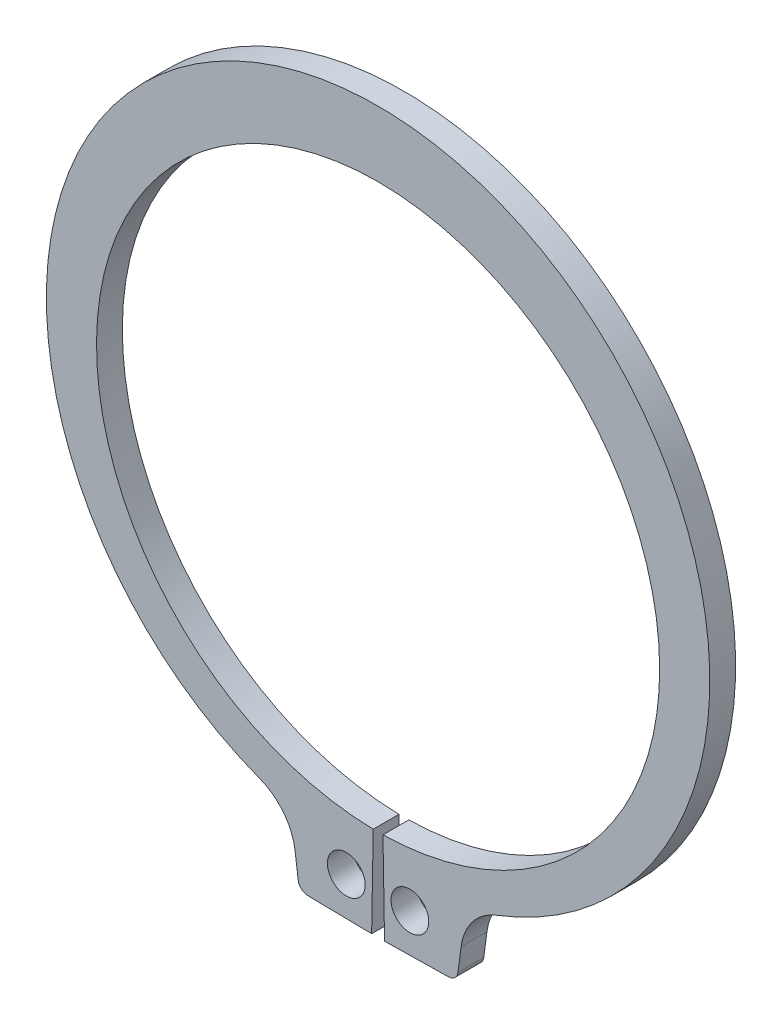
ISO-10303-21;
HEADER;
FILE_DESCRIPTION(('STEP AP214'),'2;1');
FILE_NAME('part.step','',(''),(''),'','','');
FILE_SCHEMA(('AUTOMOTIVE_DESIGN { 1 0 10303 214 1 1 1 1 }'));
ENDSEC;
DATA;
#1=APPLICATION_CONTEXT('core data for automotive mechanical design processes');
#2=APPLICATION_PROTOCOL_DEFINITION('international standard','automotive_design',2000,#1);
#3=PRODUCT_CONTEXT('',#1,'mechanical');
#4=PRODUCT('Part','Part','',(#3));
#5=PRODUCT_RELATED_PRODUCT_CATEGORY('part','',(#4));
#6=PRODUCT_DEFINITION_FORMATION('','',#4);
#7=PRODUCT_DEFINITION_CONTEXT('part definition',#1,'design');
#8=PRODUCT_DEFINITION('design','',#6,#7);
#9=PRODUCT_DEFINITION_SHAPE('','',#8);
#10=(LENGTH_UNIT() NAMED_UNIT(*) SI_UNIT(.MILLI.,.METRE.));
#11=(NAMED_UNIT(*) PLANE_ANGLE_UNIT() SI_UNIT($,.RADIAN.));
#12=(NAMED_UNIT(*) SI_UNIT($,.STERADIAN.) SOLID_ANGLE_UNIT());
#13=UNCERTAINTY_MEASURE_WITH_UNIT(LENGTH_MEASURE(1.E-05),#10,'distance_accuracy_value','');
#14=(GEOMETRIC_REPRESENTATION_CONTEXT(3) GLOBAL_UNCERTAINTY_ASSIGNED_CONTEXT((#13)) GLOBAL_UNIT_ASSIGNED_CONTEXT((#10,
#11,#12)) REPRESENTATION_CONTEXT('',''));
#15=CARTESIAN_POINT('',(0.,0.,0.));
#16=DIRECTION('',(0.,0.,1.));
#17=DIRECTION('',(1.,0.,0.));
#18=AXIS2_PLACEMENT_3D('',#15,#16,#17);
#19=CARTESIAN_POINT('',(0.,0.,-1.3));
#20=DIRECTION('',(0.,0.,1.));
#21=DIRECTION('',(1.,0.,0.));
#22=AXIS2_PLACEMENT_3D('',#19,#20,#21);
#23=CYLINDRICAL_SURFACE('',#22,14.175);
#24=CARTESIAN_POINT('',(0.,0.,0.));
#25=DIRECTION('',(0.,0.,-1.));
#26=DIRECTION('',(1.,0.,0.));
#27=AXIS2_PLACEMENT_3D('',#24,#25,#26);
#28=CIRCLE('',#27,14.175);
#29=CARTESIAN_POINT('',(-0.245372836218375,-14.1728761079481,0.));
#30=VERTEX_POINT('',#29);
#31=CARTESIAN_POINT('',(0.245372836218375,-14.1728761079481,0.));
#32=VERTEX_POINT('',#31);
#33=EDGE_CURVE('E116',#30,#32,#28,.T.);
#34=ORIENTED_EDGE('',*,*,#33,.F.);
#35=DIRECTION('',(0.,0.,1.));
#36=VECTOR('',#35,1.);
#37=CARTESIAN_POINT('',(-0.245372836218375,-14.1728761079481,-1.3));
#38=LINE('',#37,#36);
#39=CARTESIAN_POINT('',(-0.245372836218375,-14.1728761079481,-1.3));
#40=VERTEX_POINT('',#39);
#41=EDGE_CURVE('E11',#40,#30,#38,.T.);
#42=ORIENTED_EDGE('',*,*,#41,.F.);
#43=CARTESIAN_POINT('',(0.,0.,-1.3));
#44=DIRECTION('',(0.,0.,-1.));
#45=DIRECTION('',(1.,0.,0.));
#46=AXIS2_PLACEMENT_3D('',#43,#44,#45);
#47=CIRCLE('',#46,14.175);
#48=CARTESIAN_POINT('',(0.245372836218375,-14.1728761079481,-1.3));
#49=VERTEX_POINT('',#48);
#50=EDGE_CURVE('E118',#40,#49,#47,.T.);
#51=ORIENTED_EDGE('',*,*,#50,.T.);
#52=DIRECTION('',(0.,0.,1.));
#53=VECTOR('',#52,1.);
#54=CARTESIAN_POINT('',(0.245372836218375,-14.1728761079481,-1.3));
#55=LINE('',#54,#53);
#56=EDGE_CURVE('E31',#49,#32,#55,.T.);
#57=ORIENTED_EDGE('',*,*,#56,.T.);
#58=EDGE_LOOP('',(#34,#42,#51,#57));
#59=FACE_BOUND('',#58,.T.);
#60=ADVANCED_FACE('F28',(#59),#23,.F.);
#61=CARTESIAN_POINT('',(-0.245372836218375,-14.1728761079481,-1.3));
#62=DIRECTION('',(0.999850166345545,-0.0173102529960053,0.));
#63=DIRECTION('',(0.0173102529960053,0.999850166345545,0.));
#64=AXIS2_PLACEMENT_3D('',#61,#62,#63);
#65=PLANE('',#64);
#66=DIRECTION('',(0.0173102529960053,0.999850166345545,0.));
#67=VECTOR('',#66,1.);
#68=CARTESIAN_POINT('',(-0.245372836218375,-14.1728761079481,0.));
#69=LINE('',#68,#67);
#70=CARTESIAN_POINT('',(-0.325,-18.7721868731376,0.));
#71=VERTEX_POINT('',#70);
#72=EDGE_CURVE('E134',#71,#30,#69,.T.);
#73=ORIENTED_EDGE('',*,*,#72,.F.);
#74=DIRECTION('',(0.,0.,1.));
#75=VECTOR('',#74,1.);
#76=CARTESIAN_POINT('',(-0.325,-18.7721868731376,-1.3));
#77=LINE('',#76,#75);
#78=CARTESIAN_POINT('',(-0.325,-18.7721868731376,-1.3));
#79=VERTEX_POINT('',#78);
#80=EDGE_CURVE('E36',#79,#71,#77,.T.);
#81=ORIENTED_EDGE('',*,*,#80,.F.);
#82=DIRECTION('',(0.0173102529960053,0.999850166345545,0.));
#83=VECTOR('',#82,1.);
#84=CARTESIAN_POINT('',(-0.245372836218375,-14.1728761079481,-1.3));
#85=LINE('',#84,#83);
#86=EDGE_CURVE('E123',#79,#40,#85,.T.);
#87=ORIENTED_EDGE('',*,*,#86,.T.);
#88=ORIENTED_EDGE('',*,*,#41,.T.);
#89=EDGE_LOOP('',(#73,#81,#87,#88));
#90=FACE_BOUND('',#89,.T.);
#91=ADVANCED_FACE('F246',(#90),#65,.T.);
#92=CARTESIAN_POINT('',(-0.325,-18.7721868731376,-1.3));
#93=DIRECTION('',(-0.0173102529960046,-0.999850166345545,0.));
#94=DIRECTION('',(0.999850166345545,-0.0173102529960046,0.));
#95=AXIS2_PLACEMENT_3D('',#92,#93,#94);
#96=PLANE('',#95);
#97=DIRECTION('',(0.999850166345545,-0.0173102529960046,0.));
#98=VECTOR('',#97,1.);
#99=CARTESIAN_POINT('',(-0.325,-18.7721868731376,0.));
#100=LINE('',#99,#98);
#101=CARTESIAN_POINT('',(-3.53427573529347,-18.7166251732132,0.));
#102=VERTEX_POINT('',#101);
#103=EDGE_CURVE('E164',#102,#71,#100,.T.);
#104=ORIENTED_EDGE('',*,*,#103,.F.);
#105=DIRECTION('',(0.,0.,1.));
#106=VECTOR('',#105,1.);
#107=CARTESIAN_POINT('',(-3.53427573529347,-18.7166251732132,-1.3));
#108=LINE('',#107,#106);
#109=CARTESIAN_POINT('',(-3.53427573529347,-18.7166251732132,-1.3));
#110=VERTEX_POINT('',#109);
#111=EDGE_CURVE('E198',#110,#102,#108,.T.);
#112=ORIENTED_EDGE('',*,*,#111,.F.);
#113=DIRECTION('',(0.999850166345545,-0.0173102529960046,0.));
#114=VECTOR('',#113,1.);
#115=CARTESIAN_POINT('',(-0.325,-18.7721868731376,-1.3));
#116=LINE('',#115,#114);
#117=EDGE_CURVE('E194',#110,#79,#116,.T.);
#118=ORIENTED_EDGE('',*,*,#117,.T.);
#119=ORIENTED_EDGE('',*,*,#80,.T.);
#120=EDGE_LOOP('',(#104,#112,#118,#119));
#121=FACE_BOUND('',#120,.T.);
#122=ADVANCED_FACE('F251',(#121),#96,.T.);
#123=CARTESIAN_POINT('',(-3.52562060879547,-18.2167000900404,-1.3));
#124=DIRECTION('',(0.,0.,1.));
#125=DIRECTION('',(1.,0.,0.));
#126=AXIS2_PLACEMENT_3D('',#123,#124,#125);
#127=CYLINDRICAL_SURFACE('',#126,0.5);
#128=CARTESIAN_POINT('',(-3.52562060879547,-18.2167000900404,0.));
#129=DIRECTION('',(0.,0.,1.));
#130=DIRECTION('',(1.,0.,0.));
#131=AXIS2_PLACEMENT_3D('',#128,#129,#130);
#132=CIRCLE('',#131,0.5);
#133=CARTESIAN_POINT('',(-4.02134303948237,-18.2819631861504,0.));
#134=VERTEX_POINT('',#133);
#135=EDGE_CURVE('E161',#134,#102,#132,.T.);
#136=ORIENTED_EDGE('',*,*,#135,.F.);
#137=DIRECTION('',(0.,0.,1.));
#138=VECTOR('',#137,1.);
#139=CARTESIAN_POINT('',(-4.02134303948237,-18.2819631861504,-1.3));
#140=LINE('',#139,#138);
#141=CARTESIAN_POINT('',(-4.02134303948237,-18.2819631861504,-1.3));
#142=VERTEX_POINT('',#141);
#143=EDGE_CURVE('E200',#142,#134,#140,.T.);
#144=ORIENTED_EDGE('',*,*,#143,.F.);
#145=CARTESIAN_POINT('',(-3.52562060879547,-18.2167000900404,-1.3));
#146=DIRECTION('',(0.,0.,1.));
#147=DIRECTION('',(1.,0.,0.));
#148=AXIS2_PLACEMENT_3D('',#145,#146,#147);
#149=CIRCLE('',#148,0.5);
#150=EDGE_CURVE('E191',#142,#110,#149,.T.);
#151=ORIENTED_EDGE('',*,*,#150,.T.);
#152=ORIENTED_EDGE('',*,*,#111,.T.);
#153=EDGE_LOOP('',(#136,#144,#151,#152));
#154=FACE_BOUND('',#153,.T.);
#155=ADVANCED_FACE('F243',(#154),#127,.T.);
#156=CARTESIAN_POINT('',(-4.18045351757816,-17.0733991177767,-1.3));
#157=DIRECTION('',(-0.99144486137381,-0.130526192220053,0.));
#158=DIRECTION('',(0.130526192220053,-0.99144486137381,0.));
#159=AXIS2_PLACEMENT_3D('',#156,#157,#158);
#160=PLANE('',#159);
#161=DIRECTION('',(0.130526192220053,-0.99144486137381,0.));
#162=VECTOR('',#161,1.);
#163=CARTESIAN_POINT('',(-4.18045351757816,-17.0733991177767,0.));
#164=LINE('',#163,#162);
#165=CARTESIAN_POINT('',(-4.18045351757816,-17.0733991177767,0.));
#166=VERTEX_POINT('',#165);
#167=EDGE_CURVE('E158',#166,#134,#164,.T.);
#168=ORIENTED_EDGE('',*,*,#167,.F.);
#169=DIRECTION('',(0.,0.,1.));
#170=VECTOR('',#169,1.);
#171=CARTESIAN_POINT('',(-4.18045351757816,-17.0733991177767,-1.3));
#172=LINE('',#171,#170);
#173=CARTESIAN_POINT('',(-4.18045351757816,-17.0733991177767,-1.3));
#174=VERTEX_POINT('',#173);
#175=EDGE_CURVE('E202',#174,#166,#172,.T.);
#176=ORIENTED_EDGE('',*,*,#175,.F.);
#177=DIRECTION('',(0.130526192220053,-0.99144486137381,0.));
#178=VECTOR('',#177,1.);
#179=CARTESIAN_POINT('',(-4.18045351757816,-17.0733991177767,-1.3));
#180=LINE('',#179,#178);
#181=EDGE_CURVE('E188',#174,#142,#180,.T.);
#182=ORIENTED_EDGE('',*,*,#181,.T.);
#183=ORIENTED_EDGE('',*,*,#143,.T.);
#184=EDGE_LOOP('',(#168,#176,#182,#183));
#185=FACE_BOUND('',#184,.T.);
#186=ADVANCED_FACE('F239',(#185),#160,.T.);
#187=CARTESIAN_POINT('',(-6.95614636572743,-17.438826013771,-1.3));
#188=DIRECTION('',(0.,0.,1.));
#189=DIRECTION('',(1.,0.,0.));
#190=AXIS2_PLACEMENT_3D('',#187,#188,#189);
#191=CYLINDRICAL_SURFACE('',#190,2.79964419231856);
#192=CARTESIAN_POINT('',(-6.95614636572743,-17.438826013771,0.));
#193=DIRECTION('',(0.,0.,-1.));
#194=DIRECTION('',(1.,0.,0.));
#195=AXIS2_PLACEMENT_3D('',#192,#193,#194);
#196=CIRCLE('',#195,2.79964419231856);
#197=CARTESIAN_POINT('',(-5.95735269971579,-14.8234065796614,0.));
#198=VERTEX_POINT('',#197);
#199=EDGE_CURVE('E155',#198,#166,#196,.T.);
#200=ORIENTED_EDGE('',*,*,#199,.F.);
#201=DIRECTION('',(0.,0.,1.));
#202=VECTOR('',#201,1.);
#203=CARTESIAN_POINT('',(-5.95735269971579,-14.8234065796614,-1.3));
#204=LINE('',#203,#202);
#205=CARTESIAN_POINT('',(-5.95735269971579,-14.8234065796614,-1.3));
#206=VERTEX_POINT('',#205);
#207=EDGE_CURVE('E204',#206,#198,#204,.T.);
#208=ORIENTED_EDGE('',*,*,#207,.F.);
#209=CARTESIAN_POINT('',(-6.95614636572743,-17.438826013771,-1.3));
#210=DIRECTION('',(0.,0.,-1.));
#211=DIRECTION('',(1.,0.,0.));
#212=AXIS2_PLACEMENT_3D('',#209,#210,#211);
#213=CIRCLE('',#212,2.79964419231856);
#214=EDGE_CURVE('E185',#206,#174,#213,.T.);
#215=ORIENTED_EDGE('',*,*,#214,.T.);
#216=ORIENTED_EDGE('',*,*,#175,.T.);
#217=EDGE_LOOP('',(#200,#208,#215,#216));
#218=FACE_BOUND('',#217,.T.);
#219=ADVANCED_FACE('F235',(#218),#191,.F.);
#220=CARTESIAN_POINT('',(0.,0.776388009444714,-1.3));
#221=DIRECTION('',(0.,0.,1.));
#222=DIRECTION('',(1.,0.,0.));
#223=AXIS2_PLACEMENT_3D('',#220,#221,#222);
#224=CYLINDRICAL_SURFACE('',#223,16.6986119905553);
#225=CARTESIAN_POINT('',(0.,0.776388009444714,0.));
#226=DIRECTION('',(0.,0.,1.));
#227=DIRECTION('',(1.,0.,0.));
#228=AXIS2_PLACEMENT_3D('',#225,#226,#227);
#229=CIRCLE('',#228,16.6986119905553);
#230=CARTESIAN_POINT('',(5.95735269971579,-14.8234065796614,0.));
#231=VERTEX_POINT('',#230);
#232=EDGE_CURVE('E152',#231,#198,#229,.T.);
#233=ORIENTED_EDGE('',*,*,#232,.F.);
#234=DIRECTION('',(0.,0.,1.));
#235=VECTOR('',#234,1.);
#236=CARTESIAN_POINT('',(5.95735269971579,-14.8234065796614,-1.3));
#237=LINE('',#236,#235);
#238=CARTESIAN_POINT('',(5.95735269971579,-14.8234065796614,-1.3));
#239=VERTEX_POINT('',#238);
#240=EDGE_CURVE('E206',#239,#231,#237,.T.);
#241=ORIENTED_EDGE('',*,*,#240,.F.);
#242=CARTESIAN_POINT('',(0.,0.776388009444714,-1.3));
#243=DIRECTION('',(0.,0.,1.));
#244=DIRECTION('',(1.,0.,0.));
#245=AXIS2_PLACEMENT_3D('',#242,#243,#244);
#246=CIRCLE('',#245,16.6986119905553);
#247=EDGE_CURVE('E182',#239,#206,#246,.T.);
#248=ORIENTED_EDGE('',*,*,#247,.T.);
#249=ORIENTED_EDGE('',*,*,#207,.T.);
#250=EDGE_LOOP('',(#233,#241,#248,#249));
#251=FACE_BOUND('',#250,.T.);
#252=ADVANCED_FACE('F231',(#251),#224,.T.);
#253=CARTESIAN_POINT('',(6.95614636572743,-17.438826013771,-1.3));
#254=DIRECTION('',(0.,0.,1.));
#255=DIRECTION('',(1.,0.,0.));
#256=AXIS2_PLACEMENT_3D('',#253,#254,#255);
#257=CYLINDRICAL_SURFACE('',#256,2.79964419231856);
#258=CARTESIAN_POINT('',(6.95614636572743,-17.438826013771,0.));
#259=DIRECTION('',(0.,0.,-1.));
#260=DIRECTION('',(1.,0.,0.));
#261=AXIS2_PLACEMENT_3D('',#258,#259,#260);
#262=CIRCLE('',#261,2.79964419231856);
#263=CARTESIAN_POINT('',(4.18045351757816,-17.0733991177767,0.));
#264=VERTEX_POINT('',#263);
#265=EDGE_CURVE('E149',#264,#231,#262,.T.);
#266=ORIENTED_EDGE('',*,*,#265,.F.);
#267=DIRECTION('',(0.,0.,1.));
#268=VECTOR('',#267,1.);
#269=CARTESIAN_POINT('',(4.18045351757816,-17.0733991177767,-1.3));
#270=LINE('',#269,#268);
#271=CARTESIAN_POINT('',(4.18045351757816,-17.0733991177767,-1.3));
#272=VERTEX_POINT('',#271);
#273=EDGE_CURVE('E208',#272,#264,#270,.T.);
#274=ORIENTED_EDGE('',*,*,#273,.F.);
#275=CARTESIAN_POINT('',(6.95614636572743,-17.438826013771,-1.3));
#276=DIRECTION('',(0.,0.,-1.));
#277=DIRECTION('',(1.,0.,0.));
#278=AXIS2_PLACEMENT_3D('',#275,#276,#277);
#279=CIRCLE('',#278,2.79964419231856);
#280=EDGE_CURVE('E179',#272,#239,#279,.T.);
#281=ORIENTED_EDGE('',*,*,#280,.T.);
#282=ORIENTED_EDGE('',*,*,#240,.T.);
#283=EDGE_LOOP('',(#266,#274,#281,#282));
#284=FACE_BOUND('',#283,.T.);
#285=ADVANCED_FACE('F227',(#284),#257,.F.);
#286=CARTESIAN_POINT('',(4.18045351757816,-17.0733991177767,-1.3));
#287=DIRECTION('',(0.99144486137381,-0.130526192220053,0.));
#288=DIRECTION('',(0.130526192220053,0.99144486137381,0.));
#289=AXIS2_PLACEMENT_3D('',#286,#287,#288);
#290=PLANE('',#289);
#291=DIRECTION('',(0.130526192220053,0.99144486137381,0.));
#292=VECTOR('',#291,1.);
#293=CARTESIAN_POINT('',(4.18045351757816,-17.0733991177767,0.));
#294=LINE('',#293,#292);
#295=CARTESIAN_POINT('',(4.02134303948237,-18.2819631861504,0.));
#296=VERTEX_POINT('',#295);
#297=EDGE_CURVE('E146',#296,#264,#294,.T.);
#298=ORIENTED_EDGE('',*,*,#297,.F.);
#299=DIRECTION('',(0.,0.,1.));
#300=VECTOR('',#299,1.);
#301=CARTESIAN_POINT('',(4.02134303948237,-18.2819631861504,-1.3));
#302=LINE('',#301,#300);
#303=CARTESIAN_POINT('',(4.02134303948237,-18.2819631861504,-1.3));
#304=VERTEX_POINT('',#303);
#305=EDGE_CURVE('E210',#304,#296,#302,.T.);
#306=ORIENTED_EDGE('',*,*,#305,.F.);
#307=DIRECTION('',(0.130526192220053,0.99144486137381,0.));
#308=VECTOR('',#307,1.);
#309=CARTESIAN_POINT('',(4.18045351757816,-17.0733991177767,-1.3));
#310=LINE('',#309,#308);
#311=EDGE_CURVE('E176',#304,#272,#310,.T.);
#312=ORIENTED_EDGE('',*,*,#311,.T.);
#313=ORIENTED_EDGE('',*,*,#273,.T.);
#314=EDGE_LOOP('',(#298,#306,#312,#313));
#315=FACE_BOUND('',#314,.T.);
#316=ADVANCED_FACE('F223',(#315),#290,.T.);
#317=CARTESIAN_POINT('',(3.52562060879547,-18.2167000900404,-1.3));
#318=DIRECTION('',(0.,0.,1.));
#319=DIRECTION('',(1.,0.,0.));
#320=AXIS2_PLACEMENT_3D('',#317,#318,#319);
#321=CYLINDRICAL_SURFACE('',#320,0.5);
#322=CARTESIAN_POINT('',(3.52562060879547,-18.2167000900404,0.));
#323=DIRECTION('',(0.,0.,1.));
#324=DIRECTION('',(-1.,0.,0.));
#325=AXIS2_PLACEMENT_3D('',#322,#323,#324);
#326=CIRCLE('',#325,0.5);
#327=CARTESIAN_POINT('',(3.53427573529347,-18.7166251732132,0.));
#328=VERTEX_POINT('',#327);
#329=EDGE_CURVE('E143',#328,#296,#326,.T.);
#330=ORIENTED_EDGE('',*,*,#329,.F.);
#331=DIRECTION('',(0.,0.,1.));
#332=VECTOR('',#331,1.);
#333=CARTESIAN_POINT('',(3.53427573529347,-18.7166251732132,-1.3));
#334=LINE('',#333,#332);
#335=CARTESIAN_POINT('',(3.53427573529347,-18.7166251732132,-1.3));
#336=VERTEX_POINT('',#335);
#337=EDGE_CURVE('E212',#336,#328,#334,.T.);
#338=ORIENTED_EDGE('',*,*,#337,.F.);
#339=CARTESIAN_POINT('',(3.52562060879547,-18.2167000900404,-1.3));
#340=DIRECTION('',(0.,0.,1.));
#341=DIRECTION('',(-1.,0.,0.));
#342=AXIS2_PLACEMENT_3D('',#339,#340,#341);
#343=CIRCLE('',#342,0.5);
#344=EDGE_CURVE('E173',#336,#304,#343,.T.);
#345=ORIENTED_EDGE('',*,*,#344,.T.);
#346=ORIENTED_EDGE('',*,*,#305,.T.);
#347=EDGE_LOOP('',(#330,#338,#345,#346));
#348=FACE_BOUND('',#347,.T.);
#349=ADVANCED_FACE('F219',(#348),#321,.T.);
#350=CARTESIAN_POINT('',(0.325,-18.7721868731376,-1.3));
#351=DIRECTION('',(0.0173102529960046,-0.999850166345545,0.));
#352=DIRECTION('',(0.999850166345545,0.0173102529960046,0.));
#353=AXIS2_PLACEMENT_3D('',#350,#351,#352);
#354=PLANE('',#353);
#355=DIRECTION('',(0.999850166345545,0.0173102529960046,0.));
#356=VECTOR('',#355,1.);
#357=CARTESIAN_POINT('',(0.325,-18.7721868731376,0.));
#358=LINE('',#357,#356);
#359=CARTESIAN_POINT('',(0.325,-18.7721868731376,0.));
#360=VERTEX_POINT('',#359);
#361=EDGE_CURVE('E130',#360,#328,#358,.T.);
#362=ORIENTED_EDGE('',*,*,#361,.F.);
#363=DIRECTION('',(0.,0.,1.));
#364=VECTOR('',#363,1.);
#365=CARTESIAN_POINT('',(0.325,-18.7721868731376,-1.3));
#366=LINE('',#365,#364);
#367=CARTESIAN_POINT('',(0.325,-18.7721868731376,-1.3));
#368=VERTEX_POINT('',#367);
#369=EDGE_CURVE('E122',#368,#360,#366,.T.);
#370=ORIENTED_EDGE('',*,*,#369,.F.);
#371=DIRECTION('',(0.999850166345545,0.0173102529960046,0.));
#372=VECTOR('',#371,1.);
#373=CARTESIAN_POINT('',(0.325,-18.7721868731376,-1.3));
#374=LINE('',#373,#372);
#375=EDGE_CURVE('E170',#368,#336,#374,.T.);
#376=ORIENTED_EDGE('',*,*,#375,.T.);
#377=ORIENTED_EDGE('',*,*,#337,.T.);
#378=EDGE_LOOP('',(#362,#370,#376,#377));
#379=FACE_BOUND('',#378,.T.);
#380=ADVANCED_FACE('F215',(#379),#354,.T.);
#381=CARTESIAN_POINT('',(0.245372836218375,-14.1728761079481,-1.3));
#382=DIRECTION('',(-0.999850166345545,-0.0173102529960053,0.));
#383=DIRECTION('',(0.0173102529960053,-0.999850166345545,0.));
#384=AXIS2_PLACEMENT_3D('',#381,#382,#383);
#385=PLANE('',#384);
#386=DIRECTION('',(0.0173102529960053,-0.999850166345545,0.));
#387=VECTOR('',#386,1.);
#388=CARTESIAN_POINT('',(0.245372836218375,-14.1728761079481,0.));
#389=LINE('',#388,#387);
#390=EDGE_CURVE('E125',#32,#360,#389,.T.);
#391=ORIENTED_EDGE('',*,*,#390,.F.);
#392=ORIENTED_EDGE('',*,*,#56,.F.);
#393=DIRECTION('',(0.0173102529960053,-0.999850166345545,0.));
#394=VECTOR('',#393,1.);
#395=CARTESIAN_POINT('',(0.245372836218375,-14.1728761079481,-1.3));
#396=LINE('',#395,#394);
#397=EDGE_CURVE('E168',#49,#368,#396,.T.);
#398=ORIENTED_EDGE('',*,*,#397,.T.);
#399=ORIENTED_EDGE('',*,*,#369,.T.);
#400=EDGE_LOOP('',(#391,#392,#398,#399));
#401=FACE_BOUND('',#400,.T.);
#402=ADVANCED_FACE('F126',(#401),#385,.T.);
#403=CARTESIAN_POINT('',(0.,0.,-1.3));
#404=DIRECTION('',(0.,0.,1.));
#405=DIRECTION('',(1.,0.,0.));
#406=AXIS2_PLACEMENT_3D('',#403,#404,#405);
#407=PLANE('',#406);
#408=CARTESIAN_POINT('',(-1.6,-16.8115334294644,-1.3));
#409=DIRECTION('',(0.,0.,1.));
#410=DIRECTION('',(1.,0.,0.));
#411=AXIS2_PLACEMENT_3D('',#408,#409,#410);
#412=CIRCLE('',#411,0.95);
#413=CARTESIAN_POINT('',(-0.65,-16.8115334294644,-1.3));
#414=VERTEX_POINT('',#413);
#415=EDGE_CURVE('E355',#414,#414,#412,.T.);
#416=ORIENTED_EDGE('',*,*,#415,.T.);
#417=EDGE_LOOP('',(#416));
#418=FACE_BOUND('',#417,.T.);
#419=CARTESIAN_POINT('',(1.6,-16.8115334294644,-1.3));
#420=DIRECTION('',(0.,0.,1.));
#421=DIRECTION('',(1.,0.,0.));
#422=AXIS2_PLACEMENT_3D('',#419,#420,#421);
#423=CIRCLE('',#422,0.95);
#424=CARTESIAN_POINT('',(2.55,-16.8115334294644,-1.3));
#425=VERTEX_POINT('',#424);
#426=EDGE_CURVE('E135',#425,#425,#423,.T.);
#427=ORIENTED_EDGE('',*,*,#426,.T.);
#428=EDGE_LOOP('',(#427));
#429=FACE_BOUND('',#428,.T.);
#430=ORIENTED_EDGE('',*,*,#50,.F.);
#431=ORIENTED_EDGE('',*,*,#86,.F.);
#432=ORIENTED_EDGE('',*,*,#117,.F.);
#433=ORIENTED_EDGE('',*,*,#150,.F.);
#434=ORIENTED_EDGE('',*,*,#181,.F.);
#435=ORIENTED_EDGE('',*,*,#214,.F.);
#436=ORIENTED_EDGE('',*,*,#247,.F.);
#437=ORIENTED_EDGE('',*,*,#280,.F.);
#438=ORIENTED_EDGE('',*,*,#311,.F.);
#439=ORIENTED_EDGE('',*,*,#344,.F.);
#440=ORIENTED_EDGE('',*,*,#375,.F.);
#441=ORIENTED_EDGE('',*,*,#397,.F.);
#442=EDGE_LOOP('',(#430,#431,#432,#433,#434,#435,#436,#437,#438,#439,#440,#441));
#443=FACE_BOUND('',#442,.T.);
#444=ADVANCED_FACE('F250',(#418,#429,#443),#407,.F.);
#445=CARTESIAN_POINT('',(0.,0.,0.));
#446=DIRECTION('',(0.,0.,1.));
#447=DIRECTION('',(1.,0.,0.));
#448=AXIS2_PLACEMENT_3D('',#445,#446,#447);
#449=PLANE('',#448);
#450=CARTESIAN_POINT('',(-1.6,-16.8115334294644,0.));
#451=DIRECTION('',(0.,0.,1.));
#452=DIRECTION('',(1.,0.,0.));
#453=AXIS2_PLACEMENT_3D('',#450,#451,#452);
#454=CIRCLE('',#453,0.95);
#455=CARTESIAN_POINT('',(-0.65,-16.8115334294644,0.));
#456=VERTEX_POINT('',#455);
#457=EDGE_CURVE('E358',#456,#456,#454,.T.);
#458=ORIENTED_EDGE('',*,*,#457,.F.);
#459=EDGE_LOOP('',(#458));
#460=FACE_BOUND('',#459,.T.);
#461=CARTESIAN_POINT('',(1.6,-16.8115334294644,0.));
#462=DIRECTION('',(0.,0.,1.));
#463=DIRECTION('',(1.,0.,0.));
#464=AXIS2_PLACEMENT_3D('',#461,#462,#463);
#465=CIRCLE('',#464,0.95);
#466=CARTESIAN_POINT('',(2.55,-16.8115334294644,0.));
#467=VERTEX_POINT('',#466);
#468=EDGE_CURVE('E138',#467,#467,#465,.T.);
#469=ORIENTED_EDGE('',*,*,#468,.F.);
#470=EDGE_LOOP('',(#469));
#471=FACE_BOUND('',#470,.T.);
#472=ORIENTED_EDGE('',*,*,#33,.T.);
#473=ORIENTED_EDGE('',*,*,#390,.T.);
#474=ORIENTED_EDGE('',*,*,#361,.T.);
#475=ORIENTED_EDGE('',*,*,#329,.T.);
#476=ORIENTED_EDGE('',*,*,#297,.T.);
#477=ORIENTED_EDGE('',*,*,#265,.T.);
#478=ORIENTED_EDGE('',*,*,#232,.T.);
#479=ORIENTED_EDGE('',*,*,#199,.T.);
#480=ORIENTED_EDGE('',*,*,#167,.T.);
#481=ORIENTED_EDGE('',*,*,#135,.T.);
#482=ORIENTED_EDGE('',*,*,#103,.T.);
#483=ORIENTED_EDGE('',*,*,#72,.T.);
#484=EDGE_LOOP('',(#472,#473,#474,#475,#476,#477,#478,#479,#480,#481,#482,#483));
#485=FACE_BOUND('',#484,.T.);
#486=ADVANCED_FACE('F132',(#460,#471,#485),#449,.T.);
#487=CARTESIAN_POINT('',(1.6,-16.8115334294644,-1.3));
#488=DIRECTION('',(0.,0.,1.));
#489=DIRECTION('',(1.,0.,0.));
#490=AXIS2_PLACEMENT_3D('',#487,#488,#489);
#491=CYLINDRICAL_SURFACE('',#490,0.95);
#492=ORIENTED_EDGE('',*,*,#426,.F.);
#493=EDGE_LOOP('',(#492));
#494=FACE_BOUND('',#493,.T.);
#495=ORIENTED_EDGE('',*,*,#468,.T.);
#496=EDGE_LOOP('',(#495));
#497=FACE_BOUND('',#496,.T.);
#498=ADVANCED_FACE('F334',(#494,#497),#491,.F.);
#499=CARTESIAN_POINT('',(-1.6,-16.8115334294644,-1.3));
#500=DIRECTION('',(0.,0.,1.));
#501=DIRECTION('',(1.,0.,0.));
#502=AXIS2_PLACEMENT_3D('',#499,#500,#501);
#503=CYLINDRICAL_SURFACE('',#502,0.95);
#504=ORIENTED_EDGE('',*,*,#415,.F.);
#505=EDGE_LOOP('',(#504));
#506=FACE_BOUND('',#505,.T.);
#507=ORIENTED_EDGE('',*,*,#457,.T.);
#508=EDGE_LOOP('',(#507));
#509=FACE_BOUND('',#508,.T.);
#510=ADVANCED_FACE('F342',(#506,#509),#503,.F.);
#511=CLOSED_SHELL('',(#60,#91,#122,#155,#186,#219,#252,#285,#316,#349,#380,#402,#444,#486,#498,#510));
#512=MANIFOLD_SOLID_BREP('B2',#511);
#513=ADVANCED_BREP_SHAPE_REPRESENTATION('',(#18,#512),#14);
#514=SHAPE_DEFINITION_REPRESENTATION(#9,#513);
ENDSEC;
END-ISO-10303-21;
